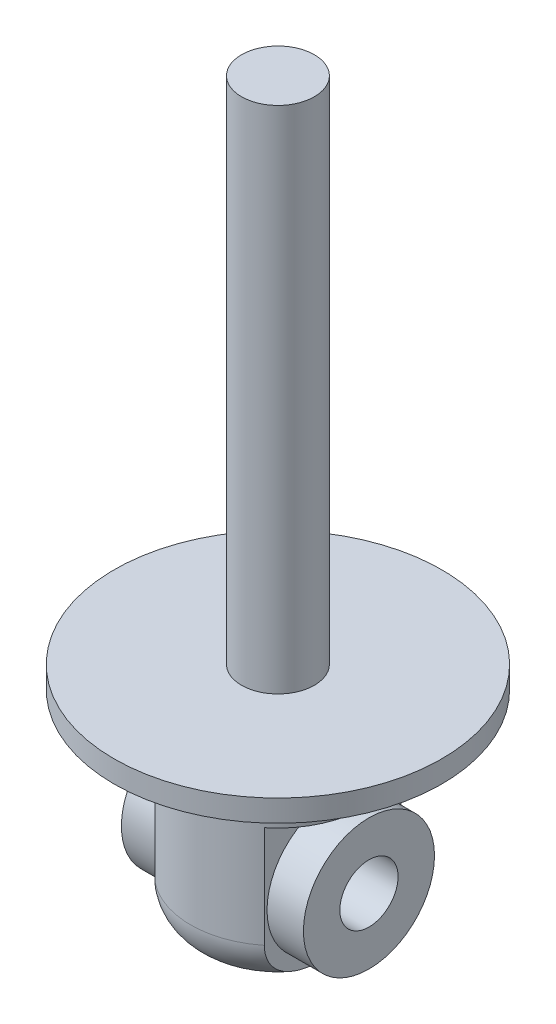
from build123d import *

# Parameters (mm, degrees)
SKETCH2_R               = 22.5
BOSS_EXTRUDE1_DEPTH     = 3
SKETCH3_R               = 5
BOSS_EXTRUDE2_DEPTH     = 70
SKETCH4_R               = 12
BOSS_EXTRUDE3_DEPTH     = 28
FILLET1_R               = 6
CUT_EXTRUDE1_DEPTH      = 80.633535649
CUT_EXTRUDE1_DEPTH_BACK = 80.633535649
SKETCH5_W               = 22.828437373
SKETCH5_H               = 20
CUT_EXTRUDE2_DEPTH      = 83.068568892
CUT_EXTRUDE2_DEPTH_BACK = 83.068568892
SKETCH6_R               = 4
SKETCH7_R               = 9
SKETCH7_R_2             = 4
BOSS_EXTRUDE4_DEPTH     = 12.5


with BuildPart() as part:
    # Sketch2 → Boss-Extrude1 (new body)
    with BuildSketch(Plane(origin=(0, 0, 0), x_dir=(1, 0, 0), z_dir=(0, 1, 0))):
        with Locations(Location((0, 0, 0), (0, 0, 270))):
            Circle(SKETCH2_R)
    extrude(amount=BOSS_EXTRUDE1_DEPTH)

    # Sketch3 → Boss-Extrude2 (add)
    with BuildSketch(Plane(origin=(0, 3, 0), x_dir=(1, 0, 0), z_dir=(0, 1, 0))):
        with Locations(Location((0, 0, 0), (0, 0, 270))):
            Circle(SKETCH3_R)
    extrude(amount=BOSS_EXTRUDE2_DEPTH)

    # Sketch4 → Boss-Extrude3 (add)
    with BuildSketch(Plane.XZ):
        with Locations(Location((0, 0, 0), (0, 0, 270))):
            Circle(SKETCH4_R)
    extrude(amount=BOSS_EXTRUDE3_DEPTH)

    # Fillet1
    fillet1_edges = [part.edges().sort_by_distance(p)[0] for p in [
        (0, -28, 12),
    ]]
    fillet(fillet1_edges, radius=FILLET1_R)

    # Sketch5 → Cut-Extrude1 (cut, two sides: drawn at the far end of the back side and taken through both)
    with BuildSketch(Plane.XY.offset(-CUT_EXTRUDE1_DEPTH_BACK)):
        with Locations((18.914218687, -18)):
            Rectangle(SKETCH5_W, SKETCH5_H)
        with Locations((-18.914218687, -18)):
            Rectangle(SKETCH5_W, SKETCH5_H)
    extrude(amount=CUT_EXTRUDE1_DEPTH + CUT_EXTRUDE1_DEPTH_BACK, mode=Mode.SUBTRACT)

    # Sketch6 → Cut-Extrude2 (cut, two sides: drawn at the far end of the back side and taken through both)
    with BuildSketch(Plane(origin=(7.5, 0, 0), x_dir=(0, 0, -1), z_dir=(1, 0, 0)).offset(-CUT_EXTRUDE2_DEPTH_BACK)):
        with Locations((0, -18)):
            Circle(SKETCH6_R)
    extrude(amount=CUT_EXTRUDE2_DEPTH + CUT_EXTRUDE2_DEPTH_BACK, mode=Mode.SUBTRACT)

    # Sketch7 → Boss-Extrude4 (add, symmetric)
    with BuildSketch(Plane(origin=(0, 0, 0), x_dir=(0, 0, -1), z_dir=(1, 0, 0))):
        with Locations(Location((0, -18, 0), (0, 0, 180))):
            Circle(SKETCH7_R)
        with Locations((0, -18)):
            Circle(SKETCH7_R_2, mode=Mode.SUBTRACT)
    extrude(amount=BOSS_EXTRUDE4_DEPTH, both=True)


solid = part.part
